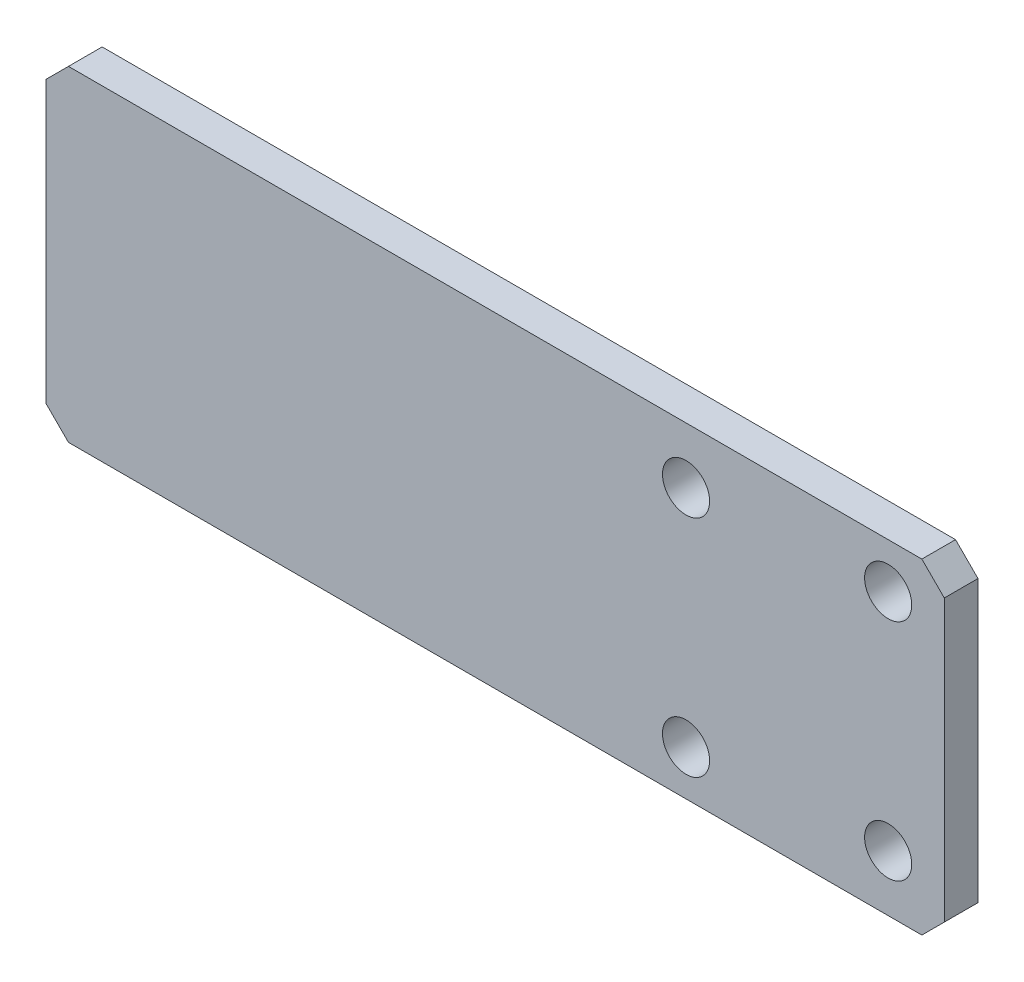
from build123d import *

# Parameters (mm, degrees)
ESQUISSE1_W      = 80
ESQUISSE1_H      = 29
ESQUISSE1_R      = 2.1
EXTRUSION1_DEPTH = 3
CHANFREIN1_SIZE  = 2


with BuildPart() as part:
    # Esquisse1 → Extrusion1 (new body)
    with BuildSketch(Plane.XY):
        with Locations((10, -0.5)):
            Rectangle(ESQUISSE1_W, ESQUISSE1_H)
        with Locations((45, 10)):
            Circle(ESQUISSE1_R, mode=Mode.SUBTRACT)
        with Locations((45, -10)):
            Circle(ESQUISSE1_R, mode=Mode.SUBTRACT)
        with Locations((27, 9)):
            Circle(ESQUISSE1_R, mode=Mode.SUBTRACT)
        with Locations((27, -11)):
            Circle(ESQUISSE1_R, mode=Mode.SUBTRACT)
    extrude(amount=EXTRUSION1_DEPTH)

    # Chanfrein1
    chanfrein1_edges = [part.edges().sort_by_distance(p)[0] for p in [
        (-30, 14, 1.5),
        (50, 14, 1.5),
        (50, -15, 1.5),
        (-30, -15, 1.5),
    ]]
    chamfer(chanfrein1_edges, length=CHANFREIN1_SIZE)


solid = part.part
